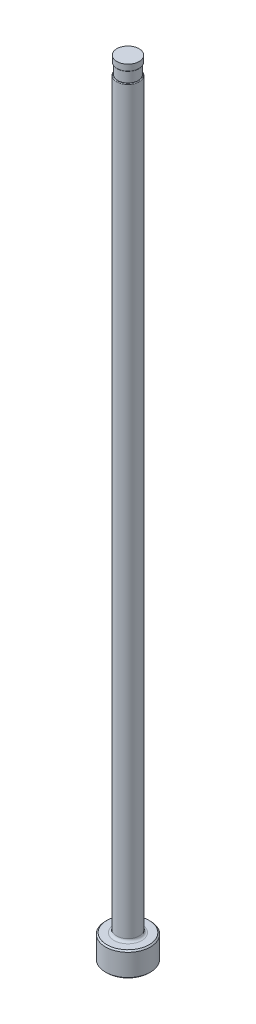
ISO-10303-21;
HEADER;
FILE_DESCRIPTION(('STEP AP214'),'2;1');
FILE_NAME('part.step','',(''),(''),'','','');
FILE_SCHEMA(('AUTOMOTIVE_DESIGN { 1 0 10303 214 1 1 1 1 }'));
ENDSEC;
DATA;
#1=APPLICATION_CONTEXT('core data for automotive mechanical design processes');
#2=APPLICATION_PROTOCOL_DEFINITION('international standard','automotive_design',2000,#1);
#3=PRODUCT_CONTEXT('',#1,'mechanical');
#4=PRODUCT('Part','Part','',(#3));
#5=PRODUCT_RELATED_PRODUCT_CATEGORY('part','',(#4));
#6=PRODUCT_DEFINITION_FORMATION('','',#4);
#7=PRODUCT_DEFINITION_CONTEXT('part definition',#1,'design');
#8=PRODUCT_DEFINITION('design','',#6,#7);
#9=PRODUCT_DEFINITION_SHAPE('','',#8);
#10=(LENGTH_UNIT() NAMED_UNIT(*) SI_UNIT(.MILLI.,.METRE.));
#11=(NAMED_UNIT(*) PLANE_ANGLE_UNIT() SI_UNIT($,.RADIAN.));
#12=(NAMED_UNIT(*) SI_UNIT($,.STERADIAN.) SOLID_ANGLE_UNIT());
#13=UNCERTAINTY_MEASURE_WITH_UNIT(LENGTH_MEASURE(1.E-05),#10,'distance_accuracy_value','');
#14=(GEOMETRIC_REPRESENTATION_CONTEXT(3) GLOBAL_UNCERTAINTY_ASSIGNED_CONTEXT((#13)) GLOBAL_UNIT_ASSIGNED_CONTEXT((#10,
#11,#12)) REPRESENTATION_CONTEXT('',''));
#15=CARTESIAN_POINT('',(0.,0.,0.));
#16=DIRECTION('',(0.,0.,1.));
#17=DIRECTION('',(1.,0.,0.));
#18=AXIS2_PLACEMENT_3D('',#15,#16,#17);
#19=CARTESIAN_POINT('',(-2.18185999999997,151.13,0.));
#20=DIRECTION('',(0.,1.,0.));
#21=DIRECTION('',(0.,0.,1.));
#22=AXIS2_PLACEMENT_3D('',#19,#20,#21);
#23=PLANE('',#22);
#24=CARTESIAN_POINT('',(0.,151.13,0.));
#25=DIRECTION('',(0.,1.,0.));
#26=DIRECTION('',(0.,0.,1.));
#27=AXIS2_PLACEMENT_3D('',#24,#25,#26);
#28=CIRCLE('',#27,2.03580999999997);
#29=CARTESIAN_POINT('',(0.,151.13,2.03580999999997));
#30=VERTEX_POINT('',#29);
#31=EDGE_CURVE('E11',#30,#30,#28,.F.);
#32=ORIENTED_EDGE('',*,*,#31,.T.);
#33=EDGE_LOOP('',(#32));
#34=FACE_BOUND('',#33,.T.);
#35=CARTESIAN_POINT('',(0.,151.13,0.));
#36=DIRECTION('',(0.,1.,0.));
#37=DIRECTION('',(0.,0.,1.));
#38=AXIS2_PLACEMENT_3D('',#35,#36,#37);
#39=CIRCLE('',#38,1.97865999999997);
#40=CARTESIAN_POINT('',(0.,151.13,1.97865999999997));
#41=VERTEX_POINT('',#40);
#42=EDGE_CURVE('E78',#41,#41,#39,.T.);
#43=ORIENTED_EDGE('',*,*,#42,.T.);
#44=EDGE_LOOP('',(#43));
#45=FACE_BOUND('',#44,.T.);
#46=ADVANCED_FACE('F36',(#34,#45),#23,.F.);
#47=CARTESIAN_POINT('',(0.,259.958771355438,0.));
#48=DIRECTION('',(0.,1.,0.));
#49=DIRECTION('',(0.,0.,1.));
#50=AXIS2_PLACEMENT_3D('',#47,#48,#49);
#51=CYLINDRICAL_SURFACE('',#50,2.18185999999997);
#52=DIRECTION('',(0.,1.,0.));
#53=VECTOR('',#52,1.);
#54=CARTESIAN_POINT('',(-1.97865999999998,259.958771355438,-0.919465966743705));
#55=LINE('',#54,#53);
#56=CARTESIAN_POINT('',(-1.97865999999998,148.971,-0.919465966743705));
#57=VERTEX_POINT('',#56);
#58=CARTESIAN_POINT('',(-1.97865999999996,86.614,-0.919465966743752));
#59=VERTEX_POINT('',#58);
#60=EDGE_CURVE('E73',#57,#59,#55,.F.);
#61=ORIENTED_EDGE('',*,*,#60,.F.);
#62=CARTESIAN_POINT('',(0.,148.971,0.));
#63=DIRECTION('',(0.,-1.,0.));
#64=DIRECTION('',(0.,0.,-1.));
#65=AXIS2_PLACEMENT_3D('',#62,#63,#64);
#66=CIRCLE('',#65,2.18185999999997);
#67=CARTESIAN_POINT('',(-1.97865999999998,148.971,0.919465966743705));
#68=VERTEX_POINT('',#67);
#69=EDGE_CURVE('E51',#57,#68,#66,.T.);
#70=ORIENTED_EDGE('',*,*,#69,.T.);
#71=DIRECTION('',(0.,1.,0.));
#72=VECTOR('',#71,1.);
#73=CARTESIAN_POINT('',(-1.97865999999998,259.958771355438,0.919465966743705));
#74=LINE('',#73,#72);
#75=CARTESIAN_POINT('',(-1.97865999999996,86.614,0.919465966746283));
#76=VERTEX_POINT('',#75);
#77=EDGE_CURVE('E84',#76,#68,#74,.T.);
#78=ORIENTED_EDGE('',*,*,#77,.F.);
#79=CARTESIAN_POINT('',(-1.97865999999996,86.614,-0.919465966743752));
#80=CARTESIAN_POINT('',(-1.97865866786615,86.5826405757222,-0.919462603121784));
#81=CARTESIAN_POINT('',(-1.97912506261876,86.5512918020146,-0.918466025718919));
#82=CARTESIAN_POINT('',(-1.98097751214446,86.4887428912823,-0.914466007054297));
#83=CARTESIAN_POINT('',(-1.98236377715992,86.4575427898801,-0.911462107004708));
#84=CARTESIAN_POINT('',(-1.98789143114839,86.3641571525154,-0.899380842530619));
#85=CARTESIAN_POINT('',(-1.99340148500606,86.302411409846,-0.887233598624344));
#86=CARTESIAN_POINT('',(-2.00766626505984,86.1814900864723,-0.854463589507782));
#87=CARTESIAN_POINT('',(-2.01642631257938,86.1223188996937,-0.833826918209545));
#88=CARTESIAN_POINT('',(-2.03642611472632,86.0083500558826,-0.783714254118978));
#89=CARTESIAN_POINT('',(-2.04766149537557,85.9535449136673,-0.754253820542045));
#90=CARTESIAN_POINT('',(-2.06976532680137,85.8574949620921,-0.691040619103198));
#91=CARTESIAN_POINT('',(-2.08046172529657,85.8154280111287,-0.658480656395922));
#92=CARTESIAN_POINT('',(-2.10182499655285,85.737320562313,-0.586722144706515));
#93=CARTESIAN_POINT('',(-2.11249187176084,85.7012795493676,-0.547524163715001));
#94=CARTESIAN_POINT('',(-2.13268121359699,85.6365154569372,-0.4627024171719));
#95=CARTESIAN_POINT('',(-2.14219477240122,85.6078476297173,-0.417033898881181));
#96=CARTESIAN_POINT('',(-2.15871707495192,85.5596764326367,-0.320671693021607));
#97=CARTESIAN_POINT('',(-2.16572797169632,85.5401651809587,-0.269982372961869));
#98=CARTESIAN_POINT('',(-2.17552234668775,85.5133195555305,-0.172335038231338));
#99=CARTESIAN_POINT('',(-2.17874151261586,85.5047183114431,-0.125766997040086));
#100=CARTESIAN_POINT('',(-2.18213487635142,85.4956577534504,-0.0317428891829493));
#101=CARTESIAN_POINT('',(-2.18231070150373,85.4951940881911,0.0157126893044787));
#102=CARTESIAN_POINT('',(-2.17970850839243,85.5021335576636,0.106163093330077));
#103=CARTESIAN_POINT('',(-2.17716289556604,85.5089177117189,0.149213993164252));
#104=CARTESIAN_POINT('',(-2.16974118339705,85.52911834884,0.233509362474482));
#105=CARTESIAN_POINT('',(-2.16486525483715,85.5425343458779,0.274753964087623));
#106=CARTESIAN_POINT('',(-2.15317272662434,85.5757261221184,0.355008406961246));
#107=CARTESIAN_POINT('',(-2.14632875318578,85.5955921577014,0.393976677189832));
#108=CARTESIAN_POINT('',(-2.13136233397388,85.64090710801,0.46823629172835));
#109=CARTESIAN_POINT('',(-2.12323947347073,85.6663578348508,0.50352643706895));
#110=CARTESIAN_POINT('',(-2.1056031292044,85.7246284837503,0.57302033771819));
#111=CARTESIAN_POINT('',(-2.09603057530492,85.7579136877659,0.606817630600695));
#112=CARTESIAN_POINT('',(-2.07698351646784,85.8291137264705,0.66911560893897));
#113=CARTESIAN_POINT('',(-2.0675090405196,85.8670298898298,0.6976147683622));
#114=CARTESIAN_POINT('',(-2.04798045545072,85.9525059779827,0.75318377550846));
#115=CARTESIAN_POINT('',(-2.03805488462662,86.0006575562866,0.779387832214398));
#116=CARTESIAN_POINT('',(-2.02005215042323,86.100471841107,0.824924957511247));
#117=CARTESIAN_POINT('',(-2.01197798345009,86.1521400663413,0.844246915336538));
#118=CARTESIAN_POINT('',(-1.99655433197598,86.2709127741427,0.880207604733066));
#119=CARTESIAN_POINT('',(-1.98987802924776,86.3386743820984,0.895000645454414));
#120=CARTESIAN_POINT('',(-1.98316702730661,86.4414162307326,0.909716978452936));
#121=CARTESIAN_POINT('',(-1.98148063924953,86.4758147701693,0.91337694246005));
#122=CARTESIAN_POINT('',(-1.97922666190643,86.5448033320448,0.918247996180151));
#123=CARTESIAN_POINT('',(-1.97865847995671,86.5793932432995,0.91946038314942));
#124=CARTESIAN_POINT('',(-1.97865999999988,86.6139999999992,0.919465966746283));
#125=B_SPLINE_CURVE_WITH_KNOTS('',3,(#79,#80,#81,#82,#83,#84,#85,#86,#87,#88,#89,#90,#91,#92,
#93,#94,#95,#96,#97,#98,#99,#100,#101,#102,#103,#104,#105,#106,#107,#108,#109,#110,#111,#112,
#113,#114,#115,#116,#117,#118,#119,#120,#121,#122,#123,#124),.UNSPECIFIED.,.F.,.F.,(4,2,2,2,2,2,
2,2,2,2,2,2,2,2,2,2,2,2,2,2,2,2,4),(0.,0.0940372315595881,0.188095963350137,0.376882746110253,
0.565980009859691,0.754745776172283,0.916867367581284,1.07897509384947,1.24226436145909,
1.40541281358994,1.54703759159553,1.68858663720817,1.8189460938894,1.94929599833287,
2.08155476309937,2.21385650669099,2.35846583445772,2.50311675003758,2.66961219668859,
2.83637523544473,3.04438491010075,3.1481998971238,3.25195984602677),.UNSPECIFIED.);
#126=EDGE_CURVE('E81',#59,#76,#125,.T.);
#127=ORIENTED_EDGE('',*,*,#126,.F.);
#128=EDGE_LOOP('',(#61,#70,#78,#127));
#129=FACE_BOUND('',#128,.T.);
#130=CARTESIAN_POINT('',(0.,5.25779999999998,0.));
#131=DIRECTION('',(0.,1.,0.));
#132=DIRECTION('',(0.,0.,1.));
#133=AXIS2_PLACEMENT_3D('',#130,#131,#132);
#134=CIRCLE('',#133,2.18185999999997);
#135=CARTESIAN_POINT('',(0.,5.25779999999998,2.18185999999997));
#136=VERTEX_POINT('',#135);
#137=EDGE_CURVE('E116',#136,#136,#134,.T.);
#138=ORIENTED_EDGE('',*,*,#137,.T.);
#139=EDGE_LOOP('',(#138));
#140=FACE_BOUND('',#139,.T.);
#141=ADVANCED_FACE('F82',(#129,#140),#51,.T.);
#142=CARTESIAN_POINT('',(0.,0.,0.));
#143=DIRECTION('',(0.,-1.,0.));
#144=DIRECTION('',(0.,0.,-1.));
#145=AXIS2_PLACEMENT_3D('',#142,#143,#144);
#146=PLANE('',#145);
#147=CARTESIAN_POINT('',(0.,0.,0.));
#148=DIRECTION('',(0.,-1.,0.));
#149=DIRECTION('',(0.,0.,-1.));
#150=AXIS2_PLACEMENT_3D('',#147,#148,#149);
#151=CIRCLE('',#150,4.10209999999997);
#152=CARTESIAN_POINT('',(0.,0.,-4.10209999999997));
#153=VERTEX_POINT('',#152);
#154=EDGE_CURVE('E113',#153,#153,#151,.T.);
#155=ORIENTED_EDGE('',*,*,#154,.T.);
#156=EDGE_LOOP('',(#155));
#157=FACE_BOUND('',#156,.T.);
#158=ADVANCED_FACE('F192',(#157),#146,.T.);
#159=CARTESIAN_POINT('',(0.,259.958771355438,0.));
#160=DIRECTION('',(0.,1.,0.));
#161=DIRECTION('',(0.,0.,1.));
#162=AXIS2_PLACEMENT_3D('',#159,#160,#161);
#163=CYLINDRICAL_SURFACE('',#162,4.35609999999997);
#164=CARTESIAN_POINT('',(0.,4.49580000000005,0.));
#165=DIRECTION('',(0.,1.,0.));
#166=DIRECTION('',(0.,0.,1.));
#167=AXIS2_PLACEMENT_3D('',#164,#165,#166);
#168=CIRCLE('',#167,4.35609999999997);
#169=CARTESIAN_POINT('',(0.,4.49580000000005,4.35609999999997));
#170=VERTEX_POINT('',#169);
#171=EDGE_CURVE('E110',#170,#170,#168,.F.);
#172=ORIENTED_EDGE('',*,*,#171,.T.);
#173=EDGE_LOOP('',(#172));
#174=FACE_BOUND('',#173,.T.);
#175=CARTESIAN_POINT('',(0.,0.253999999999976,0.));
#176=DIRECTION('',(0.,-1.,0.));
#177=DIRECTION('',(0.,0.,-1.));
#178=AXIS2_PLACEMENT_3D('',#175,#176,#177);
#179=CIRCLE('',#178,4.35609999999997);
#180=CARTESIAN_POINT('',(0.,0.253999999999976,-4.35609999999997));
#181=VERTEX_POINT('',#180);
#182=EDGE_CURVE('E107',#181,#181,#179,.F.);
#183=ORIENTED_EDGE('',*,*,#182,.T.);
#184=EDGE_LOOP('',(#183));
#185=FACE_BOUND('',#184,.T.);
#186=ADVANCED_FACE('F195',(#174,#185),#163,.T.);
#187=CARTESIAN_POINT('',(-4.35609999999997,4.7498,0.));
#188=DIRECTION('',(0.,1.,0.));
#189=DIRECTION('',(0.,0.,1.));
#190=AXIS2_PLACEMENT_3D('',#187,#188,#189);
#191=PLANE('',#190);
#192=CARTESIAN_POINT('',(0.,4.7498,0.));
#193=DIRECTION('',(0.,1.,0.));
#194=DIRECTION('',(0.,0.,1.));
#195=AXIS2_PLACEMENT_3D('',#192,#193,#194);
#196=CIRCLE('',#195,2.68985999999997);
#197=CARTESIAN_POINT('',(0.,4.7498,2.68985999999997));
#198=VERTEX_POINT('',#197);
#199=EDGE_CURVE('E87',#198,#198,#196,.F.);
#200=ORIENTED_EDGE('',*,*,#199,.T.);
#201=EDGE_LOOP('',(#200));
#202=FACE_BOUND('',#201,.T.);
#203=CARTESIAN_POINT('',(0.,4.7498,0.));
#204=DIRECTION('',(0.,1.,0.));
#205=DIRECTION('',(0.,0.,1.));
#206=AXIS2_PLACEMENT_3D('',#203,#204,#205);
#207=CIRCLE('',#206,4.10210000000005);
#208=CARTESIAN_POINT('',(0.,4.7498,4.10210000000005));
#209=VERTEX_POINT('',#208);
#210=EDGE_CURVE('E104',#209,#209,#207,.T.);
#211=ORIENTED_EDGE('',*,*,#210,.T.);
#212=EDGE_LOOP('',(#211));
#213=FACE_BOUND('',#212,.T.);
#214=ADVANCED_FACE('F190',(#202,#213),#191,.T.);
#215=CARTESIAN_POINT('',(0.,4.74980000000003,0.));
#216=DIRECTION('',(0.,-1.,0.));
#217=DIRECTION('',(0.,0.,-1.));
#218=AXIS2_PLACEMENT_3D('',#215,#216,#217);
#219=CONICAL_SURFACE('',#218,4.10210000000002,0.785398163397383);
#220=ORIENTED_EDGE('',*,*,#171,.F.);
#221=EDGE_LOOP('',(#220));
#222=FACE_BOUND('',#221,.T.);
#223=ORIENTED_EDGE('',*,*,#210,.F.);
#224=EDGE_LOOP('',(#223));
#225=FACE_BOUND('',#224,.T.);
#226=ADVANCED_FACE('F186',(#222,#225),#219,.T.);
#227=CARTESIAN_POINT('',(0.,0.253999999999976,0.));
#228=DIRECTION('',(0.,1.,0.));
#229=DIRECTION('',(0.,0.,1.));
#230=AXIS2_PLACEMENT_3D('',#227,#228,#229);
#231=CONICAL_SURFACE('',#230,4.35609999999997,0.785398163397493);
#232=ORIENTED_EDGE('',*,*,#154,.F.);
#233=EDGE_LOOP('',(#232));
#234=FACE_BOUND('',#233,.T.);
#235=ORIENTED_EDGE('',*,*,#182,.F.);
#236=EDGE_LOOP('',(#235));
#237=FACE_BOUND('',#236,.T.);
#238=ADVANCED_FACE('F182',(#234,#237),#231,.T.);
#239=CARTESIAN_POINT('',(0.,5.25779999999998,0.));
#240=DIRECTION('',(0.,1.,0.));
#241=DIRECTION('',(0.,0.,1.));
#242=AXIS2_PLACEMENT_3D('',#239,#240,#241);
#243=TOROIDAL_SURFACE('',#242,2.68985999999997,0.508);
#244=ORIENTED_EDGE('',*,*,#199,.F.);
#245=EDGE_LOOP('',(#244));
#246=FACE_BOUND('',#245,.T.);
#247=ORIENTED_EDGE('',*,*,#137,.F.);
#248=EDGE_LOOP('',(#247));
#249=FACE_BOUND('',#248,.T.);
#250=ADVANCED_FACE('F147',(#246,#249),#243,.F.);
#251=CARTESIAN_POINT('',(-2.18185999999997,149.098,0.));
#252=DIRECTION('',(0.,-1.,0.));
#253=DIRECTION('',(0.,0.,-1.));
#254=AXIS2_PLACEMENT_3D('',#251,#252,#253);
#255=PLANE('',#254);
#256=DIRECTION('',(0.,0.,1.));
#257=VECTOR('',#256,1.);
#258=CARTESIAN_POINT('',(-1.97865999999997,149.098,0.));
#259=LINE('',#258,#257);
#260=CARTESIAN_POINT('',(-1.97865999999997,149.098,0.));
#261=VERTEX_POINT('',#260);
#262=CARTESIAN_POINT('',(-1.97865999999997,149.098,0.554395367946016));
#263=VERTEX_POINT('',#262);
#264=EDGE_CURVE('E90',#261,#263,#259,.T.);
#265=ORIENTED_EDGE('',*,*,#264,.T.);
#266=CARTESIAN_POINT('',(0.,149.098,0.));
#267=DIRECTION('',(0.,-1.,0.));
#268=DIRECTION('',(0.,0.,-1.));
#269=AXIS2_PLACEMENT_3D('',#266,#267,#268);
#270=CIRCLE('',#269,2.05485999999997);
#271=CARTESIAN_POINT('',(-1.97865999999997,149.098,-0.554395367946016));
#272=VERTEX_POINT('',#271);
#273=EDGE_CURVE('E86',#263,#272,#270,.F.);
#274=ORIENTED_EDGE('',*,*,#273,.T.);
#275=EDGE_CURVE('E79',#272,#261,#259,.T.);
#276=ORIENTED_EDGE('',*,*,#275,.T.);
#277=CARTESIAN_POINT('',(0.,149.098,0.));
#278=DIRECTION('',(0.,1.,0.));
#279=DIRECTION('',(0.,0.,1.));
#280=AXIS2_PLACEMENT_3D('',#277,#278,#279);
#281=CIRCLE('',#280,1.97865999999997);
#282=EDGE_CURVE('E101',#261,#261,#281,.T.);
#283=ORIENTED_EDGE('',*,*,#282,.F.);
#284=EDGE_LOOP('',(#265,#274,#276,#283));
#285=FACE_BOUND('',#284,.T.);
#286=ADVANCED_FACE('F144',(#285),#255,.F.);
#287=CARTESIAN_POINT('',(0.,153.448281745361,0.));
#288=DIRECTION('',(0.,1.,0.));
#289=DIRECTION('',(0.,0.,1.));
#290=AXIS2_PLACEMENT_3D('',#287,#288,#289);
#291=CYLINDRICAL_SURFACE('',#290,1.97865999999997);
#292=ORIENTED_EDGE('',*,*,#42,.F.);
#293=EDGE_LOOP('',(#292));
#294=FACE_BOUND('',#293,.T.);
#295=ORIENTED_EDGE('',*,*,#282,.T.);
#296=EDGE_LOOP('',(#295));
#297=FACE_BOUND('',#296,.T.);
#298=ADVANCED_FACE('F141',(#294,#297),#291,.T.);
#299=CARTESIAN_POINT('',(-1.97865999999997,150.114,-4.35609999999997));
#300=DIRECTION('',(1.,0.,0.));
#301=DIRECTION('',(0.,1.,0.));
#302=AXIS2_PLACEMENT_3D('',#299,#300,#301);
#303=PLANE('',#302);
#304=ORIENTED_EDGE('',*,*,#275,.F.);
#305=CARTESIAN_POINT('',(-1.97865999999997,149.098,-0.554395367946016));
#306=CARTESIAN_POINT('',(-1.97865999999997,149.097980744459,-0.575592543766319));
#307=CARTESIAN_POINT('',(-1.97865999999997,149.097610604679,-0.596810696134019));
#308=CARTESIAN_POINT('',(-1.97865999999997,149.095797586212,-0.639399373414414));
#309=CARTESIAN_POINT('',(-1.97865999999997,149.094344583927,-0.660769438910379));
#310=CARTESIAN_POINT('',(-1.97865999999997,149.089969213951,-0.703485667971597));
#311=CARTESIAN_POINT('',(-1.97865999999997,149.087038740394,-0.724831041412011));
#312=CARTESIAN_POINT('',(-1.97865999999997,149.079100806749,-0.767087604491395));
#313=CARTESIAN_POINT('',(-1.97865999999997,149.074102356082,-0.788000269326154));
#314=CARTESIAN_POINT('',(-1.97865999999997,149.065075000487,-0.815870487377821));
#315=CARTESIAN_POINT('',(-1.97865999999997,149.062437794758,-0.823276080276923));
#316=CARTESIAN_POINT('',(-1.97865999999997,149.05661239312,-0.837911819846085));
#317=CARTESIAN_POINT('',(-1.97865999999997,149.053421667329,-0.845140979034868));
#318=CARTESIAN_POINT('',(-1.97865999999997,149.045442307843,-0.861139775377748));
#319=CARTESIAN_POINT('',(-1.97865999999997,149.040454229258,-0.869811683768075));
#320=CARTESIAN_POINT('',(-1.97865999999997,149.029037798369,-0.886141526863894));
#321=CARTESIAN_POINT('',(-1.97865999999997,149.022621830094,-0.893807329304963));
#322=CARTESIAN_POINT('',(-1.97865999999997,149.012411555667,-0.902964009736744));
#323=CARTESIAN_POINT('',(-1.97865999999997,149.00943102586,-0.905353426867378));
#324=CARTESIAN_POINT('',(-1.97865999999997,149.003163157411,-0.909703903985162));
#325=CARTESIAN_POINT('',(-1.97865999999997,148.999875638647,-0.911664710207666));
#326=CARTESIAN_POINT('',(-1.97865999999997,148.992965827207,-0.91503596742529));
#327=CARTESIAN_POINT('',(-1.97865999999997,148.989339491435,-0.916438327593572));
#328=CARTESIAN_POINT('',(-1.97865999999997,148.981884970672,-0.918487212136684));
#329=CARTESIAN_POINT('',(-1.97865999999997,148.978057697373,-0.919136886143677));
#330=CARTESIAN_POINT('',(-1.97865999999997,148.97314216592,-0.91943429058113));
#331=CARTESIAN_POINT('',(-1.97865999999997,148.972070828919,-0.919466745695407));
#332=CARTESIAN_POINT('',(-1.97865999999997,148.971,-0.919465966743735));
#333=B_SPLINE_CURVE_WITH_KNOTS('',3,(#305,#306,#307,#308,#309,#310,#311,#312,#313,#314,#315,
#316,#317,#318,#319,#320,#321,#322,#323,#324,#325,#326,#327,#328,#329,#330,#331,#332),
.UNSPECIFIED.,.F.,.F.,(4,2,2,2,2,2,2,2,2,2,2,2,2,4),(0.,0.0636224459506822,0.127847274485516,
0.192428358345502,0.256731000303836,0.28029891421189,0.30397752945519,0.33391323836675,
0.36359878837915,0.375030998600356,0.386469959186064,0.398069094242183,0.40961951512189,
0.412833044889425),.UNSPECIFIED.);
#334=EDGE_CURVE('E59',#272,#57,#333,.T.);
#335=ORIENTED_EDGE('',*,*,#334,.T.);
#336=ORIENTED_EDGE('',*,*,#60,.T.);
#337=DIRECTION('',(0.,0.,1.));
#338=VECTOR('',#337,1.);
#339=CARTESIAN_POINT('',(-1.97865999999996,86.614,-4.35609999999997));
#340=LINE('',#339,#338);
#341=EDGE_CURVE('E77',#59,#76,#340,.T.);
#342=ORIENTED_EDGE('',*,*,#341,.T.);
#343=ORIENTED_EDGE('',*,*,#77,.T.);
#344=CARTESIAN_POINT('',(-1.97865999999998,148.971,0.919465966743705));
#345=CARTESIAN_POINT('',(-1.97865999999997,148.974299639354,0.919474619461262));
#346=CARTESIAN_POINT('',(-1.97865999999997,148.977588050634,0.919161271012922));
#347=CARTESIAN_POINT('',(-1.97865999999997,148.984024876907,0.917970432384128));
#348=CARTESIAN_POINT('',(-1.97865999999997,148.987174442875,0.917099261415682));
#349=CARTESIAN_POINT('',(-1.97865999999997,148.994004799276,0.914610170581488));
#350=CARTESIAN_POINT('',(-1.97865999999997,148.997638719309,0.912865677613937));
#351=CARTESIAN_POINT('',(-1.97865999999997,149.004587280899,0.908811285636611));
#352=CARTESIAN_POINT('',(-1.97865999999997,149.007900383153,0.906498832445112));
#353=CARTESIAN_POINT('',(-1.97865999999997,149.016031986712,0.899998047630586));
#354=CARTESIAN_POINT('',(-1.97865999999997,149.020602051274,0.895502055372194));
#355=CARTESIAN_POINT('',(-1.97865999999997,149.029028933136,0.885897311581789));
#356=CARTESIAN_POINT('',(-1.97865999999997,149.032884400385,0.880787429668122));
#357=CARTESIAN_POINT('',(-1.97865999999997,149.043507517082,0.865009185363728));
#358=CARTESIAN_POINT('',(-1.97865999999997,149.049441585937,0.853786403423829));
#359=CARTESIAN_POINT('',(-1.97865999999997,149.059811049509,0.830611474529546));
#360=CARTESIAN_POINT('',(-1.97865999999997,149.064233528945,0.818654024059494));
#361=CARTESIAN_POINT('',(-1.97865999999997,149.074746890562,0.785643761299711));
#362=CARTESIAN_POINT('',(-1.97865999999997,149.079742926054,0.764247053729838));
#363=CARTESIAN_POINT('',(-1.97865999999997,149.087629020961,0.721022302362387));
#364=CARTESIAN_POINT('',(-1.97865999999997,149.090509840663,0.699192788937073));
#365=CARTESIAN_POINT('',(-1.97865999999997,149.094633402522,0.656787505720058));
#366=CARTESIAN_POINT('',(-1.97865999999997,149.095968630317,0.636220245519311));
#367=CARTESIAN_POINT('',(-1.97865999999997,149.097639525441,0.595227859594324));
#368=CARTESIAN_POINT('',(-1.97865999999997,149.097984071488,0.57480311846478));
#369=CARTESIAN_POINT('',(-1.97865999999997,149.098,0.55439536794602));
#370=B_SPLINE_CURVE_WITH_KNOTS('',3,(#344,#345,#346,#347,#348,#349,#350,#351,#352,#353,#354,
#355,#356,#357,#358,#359,#360,#361,#362,#363,#364,#365,#366,#367,#368,#369),.UNSPECIFIED.,.F.,
.F.,(4,2,2,2,2,2,2,2,2,2,2,2,4),(0.,0.00986593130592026,0.0196220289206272,0.0316477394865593,
0.043728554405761,0.062852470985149,0.0820121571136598,0.119885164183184,0.158074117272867,
0.223787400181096,0.28978605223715,0.351589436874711,0.412837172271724),.UNSPECIFIED.);
#371=EDGE_CURVE('E172',#68,#263,#370,.T.);
#372=ORIENTED_EDGE('',*,*,#371,.T.);
#373=ORIENTED_EDGE('',*,*,#264,.F.);
#374=EDGE_LOOP('',(#304,#335,#336,#342,#343,#372,#373));
#375=FACE_BOUND('',#374,.T.);
#376=ADVANCED_FACE('F75',(#375),#303,.F.);
#377=CARTESIAN_POINT('',(-5.15365999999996,86.614,-4.35609999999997));
#378=DIRECTION('',(0.,0.,1.));
#379=DIRECTION('',(1.,0.,0.));
#380=AXIS2_PLACEMENT_3D('',#377,#378,#379);
#381=CYLINDRICAL_SURFACE('',#380,3.175);
#382=ORIENTED_EDGE('',*,*,#341,.F.);
#383=ORIENTED_EDGE('',*,*,#126,.T.);
#384=EDGE_LOOP('',(#382,#383));
#385=FACE_BOUND('',#384,.T.);
#386=ADVANCED_FACE('F89',(#385),#381,.F.);
#387=CARTESIAN_POINT('',(0.,152.687735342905,0.));
#388=DIRECTION('',(0.,1.,0.));
#389=DIRECTION('',(0.,0.,1.));
#390=AXIS2_PLACEMENT_3D('',#387,#388,#389);
#391=CYLINDRICAL_SURFACE('',#390,2.16280999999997);
#392=CARTESIAN_POINT('',(0.,151.257,0.));
#393=DIRECTION('',(0.,1.,0.));
#394=DIRECTION('',(0.,0.,1.));
#395=AXIS2_PLACEMENT_3D('',#392,#393,#394);
#396=CIRCLE('',#395,2.16280999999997);
#397=CARTESIAN_POINT('',(0.,151.257,2.16280999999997));
#398=VERTEX_POINT('',#397);
#399=EDGE_CURVE('E44',#398,#398,#396,.T.);
#400=ORIENTED_EDGE('',*,*,#399,.T.);
#401=EDGE_LOOP('',(#400));
#402=FACE_BOUND('',#401,.T.);
#403=CARTESIAN_POINT('',(0.,152.4,0.));
#404=DIRECTION('',(0.,1.,0.));
#405=DIRECTION('',(0.,0.,1.));
#406=AXIS2_PLACEMENT_3D('',#403,#404,#405);
#407=CIRCLE('',#406,2.16280999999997);
#408=CARTESIAN_POINT('',(0.,152.4,2.16280999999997));
#409=VERTEX_POINT('',#408);
#410=EDGE_CURVE('E91',#409,#409,#407,.T.);
#411=ORIENTED_EDGE('',*,*,#410,.F.);
#412=EDGE_LOOP('',(#411));
#413=FACE_BOUND('',#412,.T.);
#414=ADVANCED_FACE('F135',(#402,#413),#391,.T.);
#415=CARTESIAN_POINT('',(-2.18185999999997,152.4,0.));
#416=DIRECTION('',(0.,1.,0.));
#417=DIRECTION('',(0.,0.,1.));
#418=AXIS2_PLACEMENT_3D('',#415,#416,#417);
#419=PLANE('',#418);
#420=ORIENTED_EDGE('',*,*,#410,.T.);
#421=EDGE_LOOP('',(#420));
#422=FACE_BOUND('',#421,.T.);
#423=ADVANCED_FACE('F149',(#422),#419,.T.);
#424=CARTESIAN_POINT('',(0.,148.971,0.));
#425=DIRECTION('',(0.,-1.,0.));
#426=DIRECTION('',(0.,0.,-1.));
#427=AXIS2_PLACEMENT_3D('',#424,#425,#426);
#428=TOROIDAL_SURFACE('',#427,2.05485999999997,0.127);
#429=ORIENTED_EDGE('',*,*,#371,.F.);
#430=ORIENTED_EDGE('',*,*,#69,.F.);
#431=ORIENTED_EDGE('',*,*,#334,.F.);
#432=ORIENTED_EDGE('',*,*,#273,.F.);
#433=EDGE_LOOP('',(#429,#430,#431,#432));
#434=FACE_BOUND('',#433,.T.);
#435=ADVANCED_FACE('F151',(#434),#428,.T.);
#436=CARTESIAN_POINT('',(0.,151.257,0.));
#437=DIRECTION('',(0.,1.,0.));
#438=DIRECTION('',(0.,0.,1.));
#439=AXIS2_PLACEMENT_3D('',#436,#437,#438);
#440=TOROIDAL_SURFACE('',#439,2.03580999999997,0.127);
#441=ORIENTED_EDGE('',*,*,#31,.F.);
#442=EDGE_LOOP('',(#441));
#443=FACE_BOUND('',#442,.T.);
#444=ORIENTED_EDGE('',*,*,#399,.F.);
#445=EDGE_LOOP('',(#444));
#446=FACE_BOUND('',#445,.T.);
#447=ADVANCED_FACE('F38',(#443,#446),#440,.T.);
#448=CLOSED_SHELL('',(#46,#141,#158,#186,#214,#226,#238,#250,#286,#298,#376,#386,#414,#423,#435,#447));
#449=MANIFOLD_SOLID_BREP('B2',#448);
#450=ADVANCED_BREP_SHAPE_REPRESENTATION('',(#18,#449),#14);
#451=SHAPE_DEFINITION_REPRESENTATION(#9,#450);
ENDSEC;
END-ISO-10303-21;
